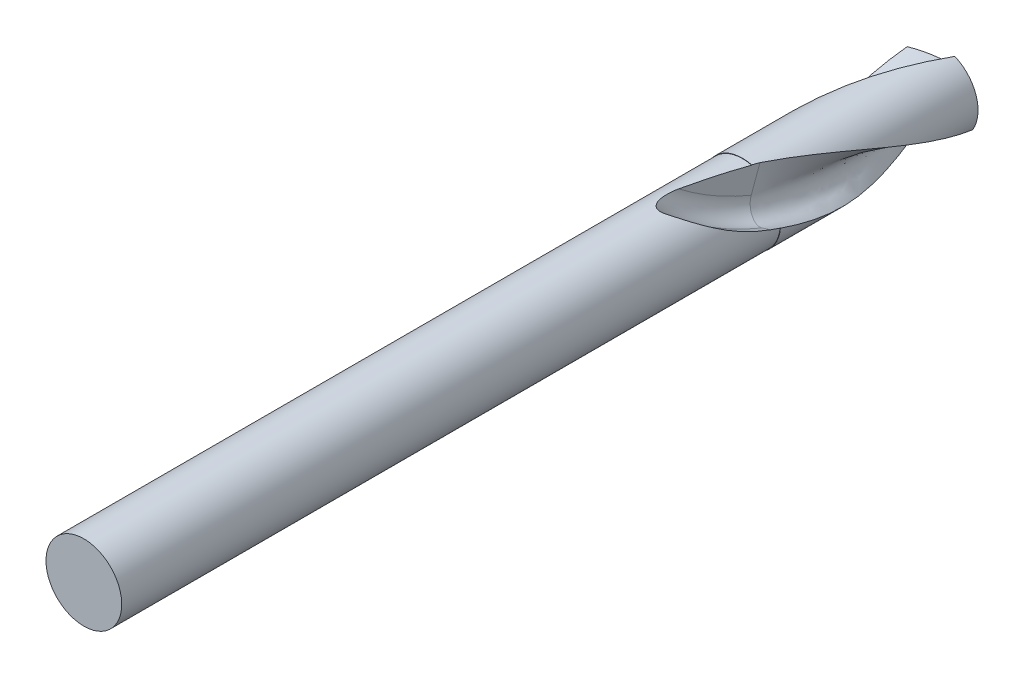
from build123d import *

# Parameters (mm, degrees)
FOPO_DENT_PITCH       = 8.63
FOPO_DENT_HEIGHT      = 3.375
FOPO_DENT_RADIUS      = 0.5
FOPO_DENT_START_ANGLE = 135
FOPO_DEG_ANGLE        = 90
REP_COUNT             = 2


with BuildPart() as part:
    # EsqCorps → CorpsOutil (revolve)
    with BuildSketch(Plane(origin=(0, 0, 0), x_dir=(0, 0, -1), z_dir=(1, 0, 0)), mode=Mode.PRIVATE) as corpsoutil_sk:
        Polygon((0, 0), (-11.5, 0), (-11.5, 0.496), (-2.875, 0.496), (-2.875, 0.5), (-0.288675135, 0.5), align=None)
    revolve(corpsoutil_sk.sketch.rotate(Axis((0, 0, 0.300640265), (0, 0, -1)), 180), axis=Axis((0, 0, 0.300640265), (0, 0, -1)))

    # FOPO-Dent: sweep along a helix
    with BuildLine() as fopo_dent_path:
        add(Helix(FOPO_DENT_PITCH, FOPO_DENT_HEIGHT, FOPO_DENT_RADIUS, center=(0, 0, 2.875), direction=(0, 0, -1), mode=Mode.PRIVATE).rotate(Axis((0, 0, 2.875), (0, 0, -1)), FOPO_DENT_START_ANGLE))
    # EsqDent → FOPO-Dent (sweep, cut)
    with BuildSketch(Plane(origin=(0.353553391, 0.353553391, 2.875), x_dir=(-0.9656323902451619, 0.03492966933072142, -0.257553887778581), z_dir=(0.24188076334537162, -0.2418807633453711, -0.9396740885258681))):
        with BuildLine():
            Line((0.229053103, -0.236570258), (0.229053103, 0.618524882))
            ThreePointArc((0.229053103, 0.618524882), (-0.328822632, 0.37666394), (-0.643467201, -0.143644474))
            Line((-0.643467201, -0.143644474), (-0.05547055, -0.417831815))
            ThreePointArc((-0.05547055, -0.417831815), (0.136513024, -0.405248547), (0.229053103, -0.236570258))
        make_face()
    fopo_dent = sweep(path=fopo_dent_path.line, is_frenet=True, mode=Mode.SUBTRACT)

    # EsqDeg → FOPO-Deg (revolve, cut)
    with BuildSketch(Plane(origin=(0.353553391, 0.353553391, 2.875), x_dir=(-0.9656323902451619, 0.03492966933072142, -0.257553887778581), z_dir=(0.24188076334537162, -0.2418807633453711, -0.9396740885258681))):
        with BuildLine():
            Line((0.229053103, -0.236570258), (0.229053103, 0.618524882))
            ThreePointArc((0.229053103, 0.618524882), (-0.328822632, 0.37666394), (-0.643467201, -0.143644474))
            Line((-0.643467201, -0.143644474), (-0.05547055, -0.417831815))
            ThreePointArc((-0.05547055, -0.417831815), (0.136513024, -0.405248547), (0.229053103, -0.236570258))
        make_face()
    fopo_deg = revolve(axis=Axis((1.696882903, 2.371413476, 2.701369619), (-0.9656323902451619, 0.034929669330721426, -0.25755388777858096)), revolution_arc=FOPO_DEG_ANGLE, mode=Mode.SUBTRACT)

    # Rep: FOPO-Dent, FOPO-Deg ×2 about axis
    rep_axis = Axis((0, 0, -1.449807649), (0, 0, 1))
    add([fopo_dent.rotate(rep_axis, i * 360 / REP_COUNT) for i in range(1, REP_COUNT)], mode=Mode.SUBTRACT)
    add([fopo_deg.rotate(rep_axis, i * 360 / REP_COUNT) for i in range(1, REP_COUNT)], mode=Mode.SUBTRACT)


solid = part.part
